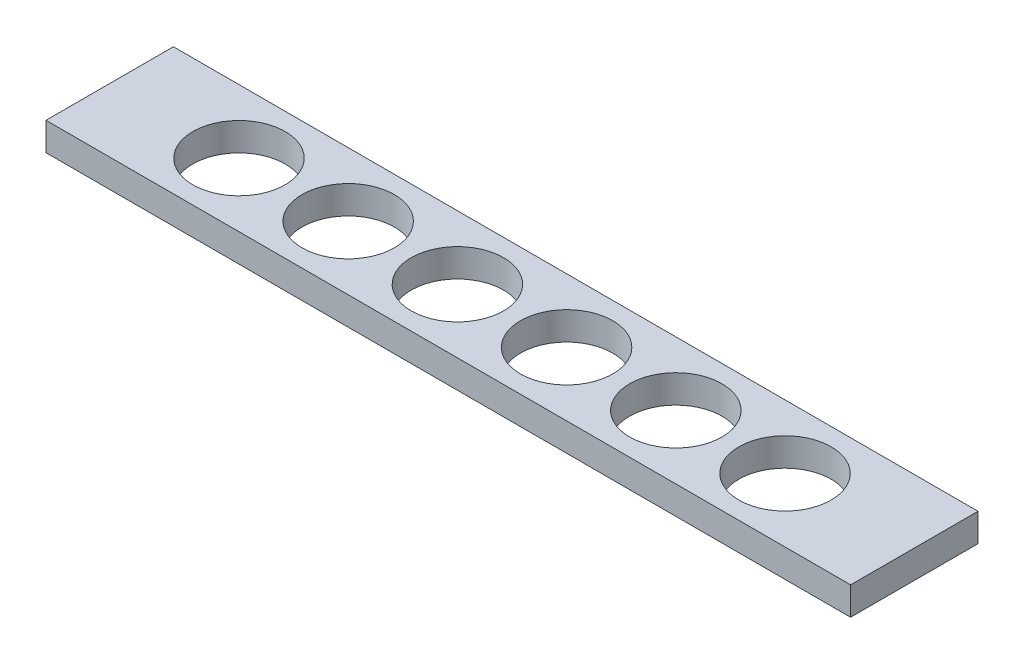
ISO-10303-21;
HEADER;
FILE_DESCRIPTION(('STEP AP214'),'2;1');
FILE_NAME('part.step','',(''),(''),'','','');
FILE_SCHEMA(('AUTOMOTIVE_DESIGN { 1 0 10303 214 1 1 1 1 }'));
ENDSEC;
DATA;
#1=APPLICATION_CONTEXT('core data for automotive mechanical design processes');
#2=APPLICATION_PROTOCOL_DEFINITION('international standard','automotive_design',2000,#1);
#3=PRODUCT_CONTEXT('',#1,'mechanical');
#4=PRODUCT('Part','Part','',(#3));
#5=PRODUCT_RELATED_PRODUCT_CATEGORY('part','',(#4));
#6=PRODUCT_DEFINITION_FORMATION('','',#4);
#7=PRODUCT_DEFINITION_CONTEXT('part definition',#1,'design');
#8=PRODUCT_DEFINITION('design','',#6,#7);
#9=PRODUCT_DEFINITION_SHAPE('','',#8);
#10=(LENGTH_UNIT() NAMED_UNIT(*) SI_UNIT(.MILLI.,.METRE.));
#11=(NAMED_UNIT(*) PLANE_ANGLE_UNIT() SI_UNIT($,.RADIAN.));
#12=(NAMED_UNIT(*) SI_UNIT($,.STERADIAN.) SOLID_ANGLE_UNIT());
#13=UNCERTAINTY_MEASURE_WITH_UNIT(LENGTH_MEASURE(1.E-05),#10,'distance_accuracy_value','');
#14=(GEOMETRIC_REPRESENTATION_CONTEXT(3) GLOBAL_UNCERTAINTY_ASSIGNED_CONTEXT((#13)) GLOBAL_UNIT_ASSIGNED_CONTEXT((#10,
#11,#12)) REPRESENTATION_CONTEXT('',''));
#15=CARTESIAN_POINT('',(0.,0.,0.));
#16=DIRECTION('',(0.,0.,1.));
#17=DIRECTION('',(1.,0.,0.));
#18=AXIS2_PLACEMENT_3D('',#15,#16,#17);
#19=CARTESIAN_POINT('',(-67.5644503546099,7.,9.95283687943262));
#20=DIRECTION('',(0.,1.,0.));
#21=DIRECTION('',(0.,0.,1.));
#22=AXIS2_PLACEMENT_3D('',#19,#20,#21);
#23=PLANE('',#22);
#24=CARTESIAN_POINT('',(68.5071496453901,7.,-5.92216312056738));
#25=DIRECTION('',(0.,1.,0.));
#26=DIRECTION('',(0.,0.,1.));
#27=AXIS2_PLACEMENT_3D('',#24,#25,#26);
#28=CIRCLE('',#27,11.5);
#29=CARTESIAN_POINT('',(68.5071496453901,7.,5.57783687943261));
#30=VERTEX_POINT('',#29);
#31=EDGE_CURVE('E109',#30,#30,#28,.T.);
#32=ORIENTED_EDGE('',*,*,#31,.F.);
#33=EDGE_LOOP('',(#32));
#34=FACE_BOUND('',#33,.T.);
#35=CARTESIAN_POINT('',(14.0781496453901,7.,-5.92216312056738));
#36=DIRECTION('',(0.,1.,0.));
#37=DIRECTION('',(0.,0.,1.));
#38=AXIS2_PLACEMENT_3D('',#35,#36,#37);
#39=CIRCLE('',#38,11.5);
#40=CARTESIAN_POINT('',(14.0781496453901,7.,5.57783687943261));
#41=VERTEX_POINT('',#40);
#42=EDGE_CURVE('E121',#41,#41,#39,.T.);
#43=ORIENTED_EDGE('',*,*,#42,.F.);
#44=EDGE_LOOP('',(#43));
#45=FACE_BOUND('',#44,.T.);
#46=CARTESIAN_POINT('',(-40.3502503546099,7.,-5.92216312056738));
#47=DIRECTION('',(0.,1.,0.));
#48=DIRECTION('',(0.,0.,1.));
#49=AXIS2_PLACEMENT_3D('',#46,#47,#48);
#50=CIRCLE('',#49,11.5);
#51=CARTESIAN_POINT('',(-40.3502503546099,7.,5.57783687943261));
#52=VERTEX_POINT('',#51);
#53=EDGE_CURVE('E133',#52,#52,#50,.T.);
#54=ORIENTED_EDGE('',*,*,#53,.F.);
#55=EDGE_LOOP('',(#54));
#56=FACE_BOUND('',#55,.T.);
#57=DIRECTION('',(-1.,0.,0.));
#58=VECTOR('',#57,1.);
#59=CARTESIAN_POINT('',(-67.5644503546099,7.,-21.7971631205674));
#60=LINE('',#59,#58);
#61=CARTESIAN_POINT('',(127.93554964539,7.,-21.7971631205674));
#62=VERTEX_POINT('',#61);
#63=CARTESIAN_POINT('',(-72.5644503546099,7.,-21.7971631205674));
#64=VERTEX_POINT('',#63);
#65=EDGE_CURVE('E11',#62,#64,#60,.T.);
#66=ORIENTED_EDGE('',*,*,#65,.T.);
#67=DIRECTION('',(0.,0.,1.));
#68=VECTOR('',#67,1.);
#69=CARTESIAN_POINT('',(-72.5644503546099,7.,-21.7971631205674));
#70=LINE('',#69,#68);
#71=CARTESIAN_POINT('',(-72.5644503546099,7.,9.95283687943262));
#72=VERTEX_POINT('',#71);
#73=EDGE_CURVE('E95',#64,#72,#70,.T.);
#74=ORIENTED_EDGE('',*,*,#73,.T.);
#75=DIRECTION('',(1.,0.,0.));
#76=VECTOR('',#75,1.);
#77=CARTESIAN_POINT('',(-67.5644503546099,7.,9.95283687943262));
#78=LINE('',#77,#76);
#79=CARTESIAN_POINT('',(127.93554964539,7.,9.95283687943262));
#80=VERTEX_POINT('',#79);
#81=EDGE_CURVE('E41',#72,#80,#78,.T.);
#82=ORIENTED_EDGE('',*,*,#81,.T.);
#83=DIRECTION('',(0.,0.,-1.));
#84=VECTOR('',#83,1.);
#85=CARTESIAN_POINT('',(127.93554964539,7.,-21.7971631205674));
#86=LINE('',#85,#84);
#87=EDGE_CURVE('E88',#80,#62,#86,.T.);
#88=ORIENTED_EDGE('',*,*,#87,.T.);
#89=EDGE_LOOP('',(#66,#74,#82,#88));
#90=FACE_BOUND('',#89,.T.);
#91=CARTESIAN_POINT('',(-13.1360503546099,7.,-5.92216312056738));
#92=DIRECTION('',(0.,1.,0.));
#93=DIRECTION('',(0.,0.,1.));
#94=AXIS2_PLACEMENT_3D('',#91,#92,#93);
#95=CIRCLE('',#94,11.5);
#96=CARTESIAN_POINT('',(-13.1360503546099,7.,5.57783687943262));
#97=VERTEX_POINT('',#96);
#98=EDGE_CURVE('E127',#97,#97,#95,.T.);
#99=ORIENTED_EDGE('',*,*,#98,.F.);
#100=EDGE_LOOP('',(#99));
#101=FACE_BOUND('',#100,.T.);
#102=CARTESIAN_POINT('',(41.2929496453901,7.,-5.92216312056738));
#103=DIRECTION('',(0.,1.,0.));
#104=DIRECTION('',(0.,0.,1.));
#105=AXIS2_PLACEMENT_3D('',#102,#103,#104);
#106=CIRCLE('',#105,11.5);
#107=CARTESIAN_POINT('',(41.2929496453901,7.,5.57783687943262));
#108=VERTEX_POINT('',#107);
#109=EDGE_CURVE('E115',#108,#108,#106,.T.);
#110=ORIENTED_EDGE('',*,*,#109,.F.);
#111=EDGE_LOOP('',(#110));
#112=FACE_BOUND('',#111,.T.);
#113=CARTESIAN_POINT('',(95.7213496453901,7.,-5.92216312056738));
#114=DIRECTION('',(0.,1.,0.));
#115=DIRECTION('',(0.,0.,1.));
#116=AXIS2_PLACEMENT_3D('',#113,#114,#115);
#117=CIRCLE('',#116,11.5);
#118=CARTESIAN_POINT('',(95.7213496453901,7.,5.57783687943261));
#119=VERTEX_POINT('',#118);
#120=EDGE_CURVE('E103',#119,#119,#117,.T.);
#121=ORIENTED_EDGE('',*,*,#120,.F.);
#122=EDGE_LOOP('',(#121));
#123=FACE_BOUND('',#122,.T.);
#124=ADVANCED_FACE('F31',(#34,#45,#56,#90,#101,#112,#123),#23,.T.);
#125=CARTESIAN_POINT('',(-67.5644503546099,0.,9.95283687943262));
#126=DIRECTION('',(0.,1.,0.));
#127=DIRECTION('',(0.,0.,1.));
#128=AXIS2_PLACEMENT_3D('',#125,#126,#127);
#129=PLANE('',#128);
#130=CARTESIAN_POINT('',(68.5071496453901,0.,-5.92216312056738));
#131=DIRECTION('',(0.,1.,0.));
#132=DIRECTION('',(0.,0.,1.));
#133=AXIS2_PLACEMENT_3D('',#130,#131,#132);
#134=CIRCLE('',#133,11.5);
#135=CARTESIAN_POINT('',(68.5071496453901,0.,5.57783687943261));
#136=VERTEX_POINT('',#135);
#137=EDGE_CURVE('E106',#136,#136,#134,.T.);
#138=ORIENTED_EDGE('',*,*,#137,.T.);
#139=EDGE_LOOP('',(#138));
#140=FACE_BOUND('',#139,.T.);
#141=CARTESIAN_POINT('',(14.0781496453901,0.,-5.92216312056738));
#142=DIRECTION('',(0.,1.,0.));
#143=DIRECTION('',(0.,0.,1.));
#144=AXIS2_PLACEMENT_3D('',#141,#142,#143);
#145=CIRCLE('',#144,11.5);
#146=CARTESIAN_POINT('',(14.0781496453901,0.,5.57783687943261));
#147=VERTEX_POINT('',#146);
#148=EDGE_CURVE('E118',#147,#147,#145,.T.);
#149=ORIENTED_EDGE('',*,*,#148,.T.);
#150=EDGE_LOOP('',(#149));
#151=FACE_BOUND('',#150,.T.);
#152=CARTESIAN_POINT('',(-40.3502503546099,0.,-5.92216312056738));
#153=DIRECTION('',(0.,1.,0.));
#154=DIRECTION('',(0.,0.,1.));
#155=AXIS2_PLACEMENT_3D('',#152,#153,#154);
#156=CIRCLE('',#155,11.5);
#157=CARTESIAN_POINT('',(-40.3502503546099,0.,5.57783687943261));
#158=VERTEX_POINT('',#157);
#159=EDGE_CURVE('E130',#158,#158,#156,.T.);
#160=ORIENTED_EDGE('',*,*,#159,.T.);
#161=EDGE_LOOP('',(#160));
#162=FACE_BOUND('',#161,.T.);
#163=DIRECTION('',(1.,0.,0.));
#164=VECTOR('',#163,1.);
#165=CARTESIAN_POINT('',(-67.5644503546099,0.,9.95283687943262));
#166=LINE('',#165,#164);
#167=CARTESIAN_POINT('',(-72.5644503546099,0.,9.95283687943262));
#168=VERTEX_POINT('',#167);
#169=CARTESIAN_POINT('',(127.93554964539,0.,9.95283687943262));
#170=VERTEX_POINT('',#169);
#171=EDGE_CURVE('E80',#168,#170,#166,.T.);
#172=ORIENTED_EDGE('',*,*,#171,.F.);
#173=DIRECTION('',(0.,0.,1.));
#174=VECTOR('',#173,1.);
#175=CARTESIAN_POINT('',(-72.5644503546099,0.,-21.7971631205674));
#176=LINE('',#175,#174);
#177=CARTESIAN_POINT('',(-72.5644503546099,0.,-21.7971631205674));
#178=VERTEX_POINT('',#177);
#179=EDGE_CURVE('E79',#178,#168,#176,.T.);
#180=ORIENTED_EDGE('',*,*,#179,.F.);
#181=DIRECTION('',(-1.,0.,0.));
#182=VECTOR('',#181,1.);
#183=CARTESIAN_POINT('',(-67.5644503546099,0.,-21.7971631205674));
#184=LINE('',#183,#182);
#185=CARTESIAN_POINT('',(127.93554964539,0.,-21.7971631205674));
#186=VERTEX_POINT('',#185);
#187=EDGE_CURVE('E35',#186,#178,#184,.T.);
#188=ORIENTED_EDGE('',*,*,#187,.F.);
#189=DIRECTION('',(0.,0.,-1.));
#190=VECTOR('',#189,1.);
#191=CARTESIAN_POINT('',(127.93554964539,0.,-21.7971631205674));
#192=LINE('',#191,#190);
#193=EDGE_CURVE('E77',#170,#186,#192,.T.);
#194=ORIENTED_EDGE('',*,*,#193,.F.);
#195=EDGE_LOOP('',(#172,#180,#188,#194));
#196=FACE_BOUND('',#195,.T.);
#197=CARTESIAN_POINT('',(-13.1360503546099,0.,-5.92216312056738));
#198=DIRECTION('',(0.,1.,0.));
#199=DIRECTION('',(0.,0.,1.));
#200=AXIS2_PLACEMENT_3D('',#197,#198,#199);
#201=CIRCLE('',#200,11.5);
#202=CARTESIAN_POINT('',(-13.1360503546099,0.,5.57783687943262));
#203=VERTEX_POINT('',#202);
#204=EDGE_CURVE('E124',#203,#203,#201,.T.);
#205=ORIENTED_EDGE('',*,*,#204,.T.);
#206=EDGE_LOOP('',(#205));
#207=FACE_BOUND('',#206,.T.);
#208=CARTESIAN_POINT('',(41.2929496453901,0.,-5.92216312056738));
#209=DIRECTION('',(0.,1.,0.));
#210=DIRECTION('',(0.,0.,1.));
#211=AXIS2_PLACEMENT_3D('',#208,#209,#210);
#212=CIRCLE('',#211,11.5);
#213=CARTESIAN_POINT('',(41.2929496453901,0.,5.57783687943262));
#214=VERTEX_POINT('',#213);
#215=EDGE_CURVE('E112',#214,#214,#212,.T.);
#216=ORIENTED_EDGE('',*,*,#215,.T.);
#217=EDGE_LOOP('',(#216));
#218=FACE_BOUND('',#217,.T.);
#219=CARTESIAN_POINT('',(95.7213496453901,0.,-5.92216312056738));
#220=DIRECTION('',(0.,1.,0.));
#221=DIRECTION('',(0.,0.,1.));
#222=AXIS2_PLACEMENT_3D('',#219,#220,#221);
#223=CIRCLE('',#222,11.5);
#224=CARTESIAN_POINT('',(95.7213496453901,0.,5.57783687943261));
#225=VERTEX_POINT('',#224);
#226=EDGE_CURVE('E102',#225,#225,#223,.T.);
#227=ORIENTED_EDGE('',*,*,#226,.T.);
#228=EDGE_LOOP('',(#227));
#229=FACE_BOUND('',#228,.T.);
#230=ADVANCED_FACE('F75',(#140,#151,#162,#196,#207,#218,#229),#129,.F.);
#231=CARTESIAN_POINT('',(-67.5644503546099,7.,9.95283687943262));
#232=DIRECTION('',(0.,0.,-1.));
#233=DIRECTION('',(-1.,0.,0.));
#234=AXIS2_PLACEMENT_3D('',#231,#232,#233);
#235=PLANE('',#234);
#236=ORIENTED_EDGE('',*,*,#171,.T.);
#237=DIRECTION('',(0.,-1.,0.));
#238=VECTOR('',#237,1.);
#239=CARTESIAN_POINT('',(127.93554964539,7.,9.95283687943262));
#240=LINE('',#239,#238);
#241=EDGE_CURVE('E87',#80,#170,#240,.T.);
#242=ORIENTED_EDGE('',*,*,#241,.F.);
#243=ORIENTED_EDGE('',*,*,#81,.F.);
#244=DIRECTION('',(0.,-1.,0.));
#245=VECTOR('',#244,1.);
#246=CARTESIAN_POINT('',(-72.5644503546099,7.,9.95283687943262));
#247=LINE('',#246,#245);
#248=EDGE_CURVE('E97',#72,#168,#247,.T.);
#249=ORIENTED_EDGE('',*,*,#248,.T.);
#250=EDGE_LOOP('',(#236,#242,#243,#249));
#251=FACE_BOUND('',#250,.T.);
#252=ADVANCED_FACE('F33',(#251),#235,.F.);
#253=CARTESIAN_POINT('',(-67.5644503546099,7.,-21.7971631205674));
#254=DIRECTION('',(0.,0.,1.));
#255=DIRECTION('',(1.,0.,0.));
#256=AXIS2_PLACEMENT_3D('',#253,#254,#255);
#257=PLANE('',#256);
#258=ORIENTED_EDGE('',*,*,#187,.T.);
#259=DIRECTION('',(0.,-1.,0.));
#260=VECTOR('',#259,1.);
#261=CARTESIAN_POINT('',(-72.5644503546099,7.,-21.7971631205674));
#262=LINE('',#261,#260);
#263=EDGE_CURVE('E100',#64,#178,#262,.T.);
#264=ORIENTED_EDGE('',*,*,#263,.F.);
#265=ORIENTED_EDGE('',*,*,#65,.F.);
#266=DIRECTION('',(0.,-1.,0.));
#267=VECTOR('',#266,1.);
#268=CARTESIAN_POINT('',(127.93554964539,7.,-21.7971631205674));
#269=LINE('',#268,#267);
#270=EDGE_CURVE('E86',#62,#186,#269,.T.);
#271=ORIENTED_EDGE('',*,*,#270,.T.);
#272=EDGE_LOOP('',(#258,#264,#265,#271));
#273=FACE_BOUND('',#272,.T.);
#274=ADVANCED_FACE('F90',(#273),#257,.F.);
#275=CARTESIAN_POINT('',(-40.3502503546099,7.,-5.92216312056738));
#276=DIRECTION('',(0.,-1.,0.));
#277=DIRECTION('',(0.,0.,-1.));
#278=AXIS2_PLACEMENT_3D('',#275,#276,#277);
#279=CYLINDRICAL_SURFACE('',#278,11.5);
#280=ORIENTED_EDGE('',*,*,#53,.T.);
#281=EDGE_LOOP('',(#280));
#282=FACE_BOUND('',#281,.T.);
#283=ORIENTED_EDGE('',*,*,#159,.F.);
#284=EDGE_LOOP('',(#283));
#285=FACE_BOUND('',#284,.T.);
#286=ADVANCED_FACE('F169',(#282,#285),#279,.F.);
#287=CARTESIAN_POINT('',(-13.1360503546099,7.,-5.92216312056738));
#288=DIRECTION('',(0.,-1.,0.));
#289=DIRECTION('',(0.,0.,-1.));
#290=AXIS2_PLACEMENT_3D('',#287,#288,#289);
#291=CYLINDRICAL_SURFACE('',#290,11.5);
#292=ORIENTED_EDGE('',*,*,#98,.T.);
#293=EDGE_LOOP('',(#292));
#294=FACE_BOUND('',#293,.T.);
#295=ORIENTED_EDGE('',*,*,#204,.F.);
#296=EDGE_LOOP('',(#295));
#297=FACE_BOUND('',#296,.T.);
#298=ADVANCED_FACE('F173',(#294,#297),#291,.F.);
#299=CARTESIAN_POINT('',(14.0781496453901,7.,-5.92216312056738));
#300=DIRECTION('',(0.,-1.,0.));
#301=DIRECTION('',(0.,0.,-1.));
#302=AXIS2_PLACEMENT_3D('',#299,#300,#301);
#303=CYLINDRICAL_SURFACE('',#302,11.5);
#304=ORIENTED_EDGE('',*,*,#42,.T.);
#305=EDGE_LOOP('',(#304));
#306=FACE_BOUND('',#305,.T.);
#307=ORIENTED_EDGE('',*,*,#148,.F.);
#308=EDGE_LOOP('',(#307));
#309=FACE_BOUND('',#308,.T.);
#310=ADVANCED_FACE('F178',(#306,#309),#303,.F.);
#311=CARTESIAN_POINT('',(41.2929496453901,7.,-5.92216312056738));
#312=DIRECTION('',(0.,-1.,0.));
#313=DIRECTION('',(0.,0.,-1.));
#314=AXIS2_PLACEMENT_3D('',#311,#312,#313);
#315=CYLINDRICAL_SURFACE('',#314,11.5);
#316=ORIENTED_EDGE('',*,*,#109,.T.);
#317=EDGE_LOOP('',(#316));
#318=FACE_BOUND('',#317,.T.);
#319=ORIENTED_EDGE('',*,*,#215,.F.);
#320=EDGE_LOOP('',(#319));
#321=FACE_BOUND('',#320,.T.);
#322=ADVANCED_FACE('F185',(#318,#321),#315,.F.);
#323=CARTESIAN_POINT('',(68.5071496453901,7.,-5.92216312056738));
#324=DIRECTION('',(0.,-1.,0.));
#325=DIRECTION('',(0.,0.,-1.));
#326=AXIS2_PLACEMENT_3D('',#323,#324,#325);
#327=CYLINDRICAL_SURFACE('',#326,11.5);
#328=ORIENTED_EDGE('',*,*,#31,.T.);
#329=EDGE_LOOP('',(#328));
#330=FACE_BOUND('',#329,.T.);
#331=ORIENTED_EDGE('',*,*,#137,.F.);
#332=EDGE_LOOP('',(#331));
#333=FACE_BOUND('',#332,.T.);
#334=ADVANCED_FACE('F156',(#330,#333),#327,.F.);
#335=CARTESIAN_POINT('',(95.7213496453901,7.,-5.92216312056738));
#336=DIRECTION('',(0.,-1.,0.));
#337=DIRECTION('',(0.,0.,-1.));
#338=AXIS2_PLACEMENT_3D('',#335,#336,#337);
#339=CYLINDRICAL_SURFACE('',#338,11.5);
#340=ORIENTED_EDGE('',*,*,#120,.T.);
#341=EDGE_LOOP('',(#340));
#342=FACE_BOUND('',#341,.T.);
#343=ORIENTED_EDGE('',*,*,#226,.F.);
#344=EDGE_LOOP('',(#343));
#345=FACE_BOUND('',#344,.T.);
#346=ADVANCED_FACE('F153',(#342,#345),#339,.F.);
#347=CARTESIAN_POINT('',(-72.5644503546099,7.,-21.7971631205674));
#348=DIRECTION('',(1.,0.,0.));
#349=DIRECTION('',(0.,0.,-1.));
#350=AXIS2_PLACEMENT_3D('',#347,#348,#349);
#351=PLANE('',#350);
#352=ORIENTED_EDGE('',*,*,#179,.T.);
#353=ORIENTED_EDGE('',*,*,#248,.F.);
#354=ORIENTED_EDGE('',*,*,#73,.F.);
#355=ORIENTED_EDGE('',*,*,#263,.T.);
#356=EDGE_LOOP('',(#352,#353,#354,#355));
#357=FACE_BOUND('',#356,.T.);
#358=ADVANCED_FACE('F140',(#357),#351,.F.);
#359=CARTESIAN_POINT('',(127.93554964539,7.,-21.7971631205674));
#360=DIRECTION('',(-1.,0.,0.));
#361=DIRECTION('',(0.,0.,1.));
#362=AXIS2_PLACEMENT_3D('',#359,#360,#361);
#363=PLANE('',#362);
#364=ORIENTED_EDGE('',*,*,#193,.T.);
#365=ORIENTED_EDGE('',*,*,#270,.F.);
#366=ORIENTED_EDGE('',*,*,#87,.F.);
#367=ORIENTED_EDGE('',*,*,#241,.T.);
#368=EDGE_LOOP('',(#364,#365,#366,#367));
#369=FACE_BOUND('',#368,.T.);
#370=ADVANCED_FACE('F84',(#369),#363,.F.);
#371=CLOSED_SHELL('',(#124,#230,#252,#274,#286,#298,#310,#322,#334,#346,#358,#370));
#372=MANIFOLD_SOLID_BREP('B2',#371);
#373=ADVANCED_BREP_SHAPE_REPRESENTATION('',(#18,#372),#14);
#374=SHAPE_DEFINITION_REPRESENTATION(#9,#373);
ENDSEC;
END-ISO-10303-21;
